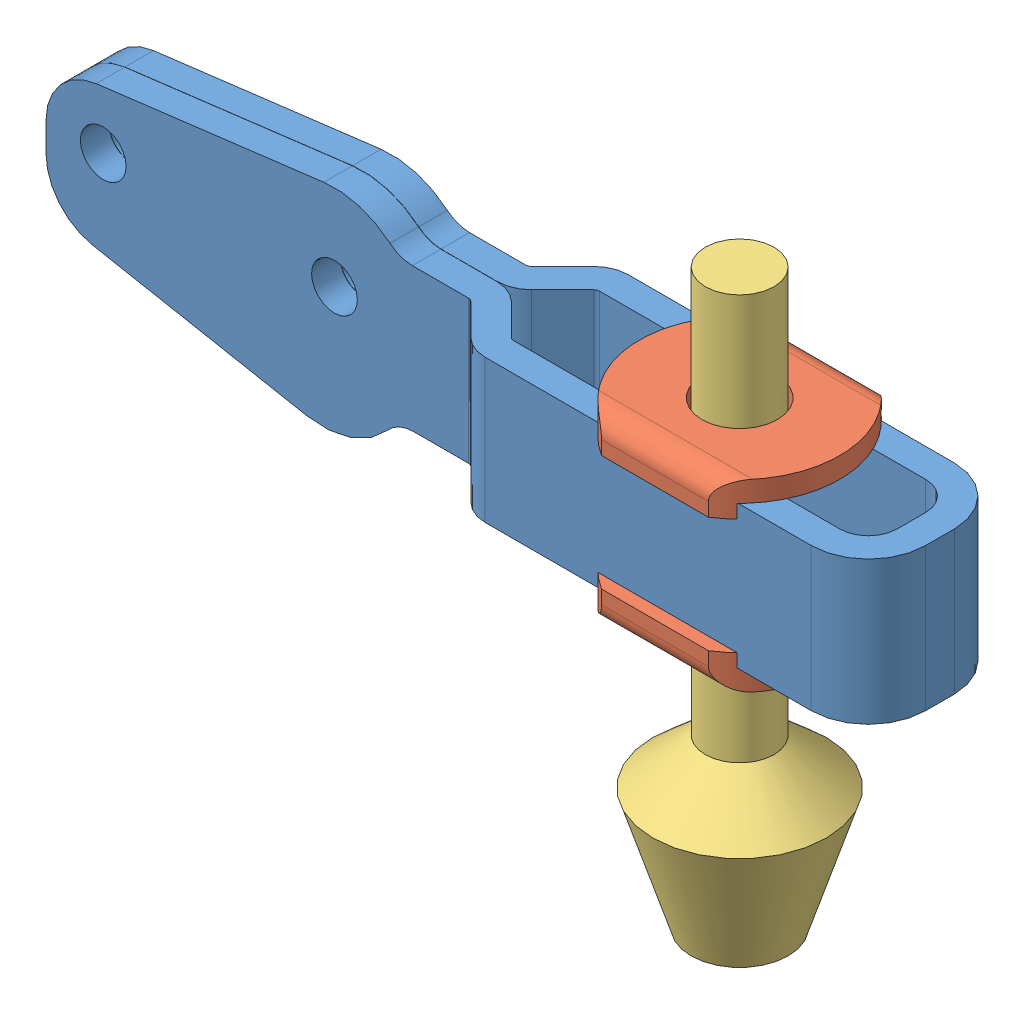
SolidWorks assembly hold-down sub-assy_&.SLDASM, configuration Default (file format 3100). Lengths in mm.
Overall size (96.01 63.5 19.3).
4 component instances, 3 part files, 10 mates.
Components (placement in the parent):
- Press Arm-1: Press Arm.SLDPRT [Default] at origin size (96.01 23.62 15.88)
- Press Washer-1: Press Washer.SLDPRT [Default] at (73.787 -2.286 0) x (0 0 -1) z (1 0 0) size (18.8 3.81 22.23)
- Press Washer-2: Press Washer.SLDPRT [Default] at (73.787 18.161 0) x (0 0 -1) z (-1 0 0) size (18.8 3.81 22.23)
- hold-down bolt_&-1: hold-down bolt_&.sldprt [Default] at (73.787 -32.766 0) size (19.3 63.5 19.3)
Mates (geometry in assembly coordinates):
- Parallel1: parallel anti-aligned: line of Press Arm-1; line of Press Washer-1
- Coincident1: coincident anti-aligned: plane of Press Arm-1; plane of Press Washer-1
- Distance1: distance = 0.0635 mm anti-aligned: plane of Press Arm-1; plane of Press Washer-1
- Coincident2: coincident anti-aligned: plane of Press Arm-1; plane of Press Washer-2
- Distance2: distance = 19.05 mm anti-aligned: plane of Press Arm-1; plane of hold-down bolt_&-1
- Concentric1: concentric anti-aligned: cylinder of Press Washer-1; cylinder of Press Washer-2
- Parallel2: parallel: line of Press Washer-1; plane of Press Washer-2
- Distance3: distance = 30.48 mm aligned: plane of Press Washer-1; plane of hold-down bolt_&-1
- Parallel3: parallel anti-aligned: plane of Press Washer-2; plane of hold-down bolt_&-1
- Concentric2: concentric anti-aligned: cylinder of Press Washer-2; cylinder of hold-down bolt_&-1
